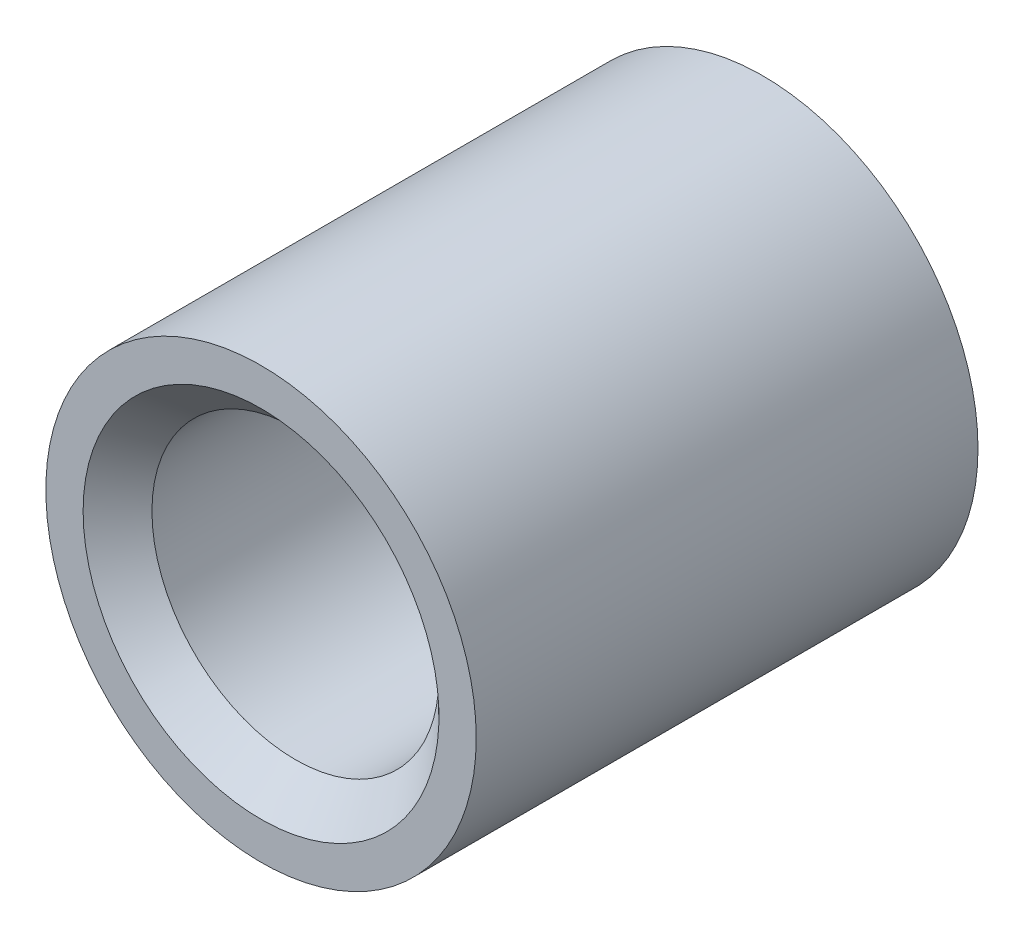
ISO-10303-21;
HEADER;
FILE_DESCRIPTION(('STEP AP214'),'2;1');
FILE_NAME('part.step','',(''),(''),'','','');
FILE_SCHEMA(('AUTOMOTIVE_DESIGN { 1 0 10303 214 1 1 1 1 }'));
ENDSEC;
DATA;
#1=APPLICATION_CONTEXT('core data for automotive mechanical design processes');
#2=APPLICATION_PROTOCOL_DEFINITION('international standard','automotive_design',2000,#1);
#3=PRODUCT_CONTEXT('',#1,'mechanical');
#4=PRODUCT('Part','Part','',(#3));
#5=PRODUCT_RELATED_PRODUCT_CATEGORY('part','',(#4));
#6=PRODUCT_DEFINITION_FORMATION('','',#4);
#7=PRODUCT_DEFINITION_CONTEXT('part definition',#1,'design');
#8=PRODUCT_DEFINITION('design','',#6,#7);
#9=PRODUCT_DEFINITION_SHAPE('','',#8);
#10=(LENGTH_UNIT() NAMED_UNIT(*) SI_UNIT(.MILLI.,.METRE.));
#11=(NAMED_UNIT(*) PLANE_ANGLE_UNIT() SI_UNIT($,.RADIAN.));
#12=(NAMED_UNIT(*) SI_UNIT($,.STERADIAN.) SOLID_ANGLE_UNIT());
#13=UNCERTAINTY_MEASURE_WITH_UNIT(LENGTH_MEASURE(1.E-05),#10,'distance_accuracy_value','');
#14=(GEOMETRIC_REPRESENTATION_CONTEXT(3) GLOBAL_UNCERTAINTY_ASSIGNED_CONTEXT((#13)) GLOBAL_UNIT_ASSIGNED_CONTEXT((#10,
#11,#12)) REPRESENTATION_CONTEXT('',''));
#15=CARTESIAN_POINT('',(0.,0.,0.));
#16=DIRECTION('',(0.,0.,1.));
#17=DIRECTION('',(1.,0.,0.));
#18=AXIS2_PLACEMENT_3D('',#15,#16,#17);
#19=CARTESIAN_POINT('',(0.,0.,31.775));
#20=DIRECTION('',(0.,0.,1.));
#21=DIRECTION('',(1.,0.,0.));
#22=AXIS2_PLACEMENT_3D('',#19,#20,#21);
#23=CYLINDRICAL_SURFACE('',#22,9.53135);
#24=CARTESIAN_POINT('',(0.,0.,0.));
#25=DIRECTION('',(0.,0.,1.));
#26=DIRECTION('',(1.,0.,0.));
#27=AXIS2_PLACEMENT_3D('',#24,#25,#26);
#28=CIRCLE('',#27,9.53135);
#29=CARTESIAN_POINT('',(9.53135,0.,0.));
#30=VERTEX_POINT('',#29);
#31=EDGE_CURVE('E32',#30,#30,#28,.T.);
#32=ORIENTED_EDGE('',*,*,#31,.F.);
#33=EDGE_LOOP('',(#32));
#34=FACE_BOUND('',#33,.T.);
#35=CARTESIAN_POINT('',(0.,0.,-22.225));
#36=DIRECTION('',(0.,0.,1.));
#37=DIRECTION('',(1.,0.,0.));
#38=AXIS2_PLACEMENT_3D('',#35,#36,#37);
#39=CIRCLE('',#38,9.53135);
#40=CARTESIAN_POINT('',(9.53135,0.,-22.225));
#41=VERTEX_POINT('',#40);
#42=EDGE_CURVE('E35',#41,#41,#39,.T.);
#43=ORIENTED_EDGE('',*,*,#42,.T.);
#44=EDGE_LOOP('',(#43));
#45=FACE_BOUND('',#44,.T.);
#46=ADVANCED_FACE('F13',(#34,#45),#23,.T.);
#47=CARTESIAN_POINT('',(9.53135,0.,0.));
#48=DIRECTION('',(0.,0.,-1.));
#49=DIRECTION('',(-1.,0.,0.));
#50=AXIS2_PLACEMENT_3D('',#47,#48,#49);
#51=PLANE('',#50);
#52=CARTESIAN_POINT('',(0.,0.,0.));
#53=DIRECTION('',(0.,0.,-1.));
#54=DIRECTION('',(-1.,0.,0.));
#55=AXIS2_PLACEMENT_3D('',#52,#53,#54);
#56=CIRCLE('',#55,7.88035);
#57=CARTESIAN_POINT('',(-7.88035,0.,0.));
#58=VERTEX_POINT('',#57);
#59=EDGE_CURVE('E9',#58,#58,#56,.T.);
#60=ORIENTED_EDGE('',*,*,#59,.T.);
#61=EDGE_LOOP('',(#60));
#62=FACE_BOUND('',#61,.T.);
#63=ORIENTED_EDGE('',*,*,#31,.T.);
#64=EDGE_LOOP('',(#63));
#65=FACE_BOUND('',#64,.T.);
#66=ADVANCED_FACE('F55',(#62,#65),#51,.F.);
#67=CARTESIAN_POINT('',(0.,0.,31.775));
#68=DIRECTION('',(0.,0.,1.));
#69=DIRECTION('',(1.,0.,0.));
#70=AXIS2_PLACEMENT_3D('',#67,#68,#69);
#71=CYLINDRICAL_SURFACE('',#70,6.35635);
#72=CARTESIAN_POINT('',(0.,0.,-20.701));
#73=DIRECTION('',(0.,0.,1.));
#74=DIRECTION('',(1.,0.,0.));
#75=AXIS2_PLACEMENT_3D('',#72,#73,#74);
#76=CIRCLE('',#75,6.35635);
#77=CARTESIAN_POINT('',(6.35635,0.,-20.701));
#78=VERTEX_POINT('',#77);
#79=EDGE_CURVE('E19',#78,#78,#76,.F.);
#80=ORIENTED_EDGE('',*,*,#79,.T.);
#81=EDGE_LOOP('',(#80));
#82=FACE_BOUND('',#81,.T.);
#83=CARTESIAN_POINT('',(0.,0.,-1.524));
#84=DIRECTION('',(0.,0.,-1.));
#85=DIRECTION('',(-1.,0.,0.));
#86=AXIS2_PLACEMENT_3D('',#83,#84,#85);
#87=CIRCLE('',#86,6.35635);
#88=CARTESIAN_POINT('',(-6.35635,0.,-1.524));
#89=VERTEX_POINT('',#88);
#90=EDGE_CURVE('E23',#89,#89,#87,.F.);
#91=ORIENTED_EDGE('',*,*,#90,.T.);
#92=EDGE_LOOP('',(#91));
#93=FACE_BOUND('',#92,.T.);
#94=ADVANCED_FACE('F43',(#82,#93),#71,.F.);
#95=CARTESIAN_POINT('',(6.35635,0.,-22.225));
#96=DIRECTION('',(0.,0.,1.));
#97=DIRECTION('',(1.,0.,0.));
#98=AXIS2_PLACEMENT_3D('',#95,#96,#97);
#99=PLANE('',#98);
#100=CARTESIAN_POINT('',(0.,0.,-22.225));
#101=DIRECTION('',(0.,0.,1.));
#102=DIRECTION('',(1.,0.,0.));
#103=AXIS2_PLACEMENT_3D('',#100,#101,#102);
#104=CIRCLE('',#103,7.88035);
#105=CARTESIAN_POINT('',(7.88035,0.,-22.225));
#106=VERTEX_POINT('',#105);
#107=EDGE_CURVE('E27',#106,#106,#104,.T.);
#108=ORIENTED_EDGE('',*,*,#107,.T.);
#109=EDGE_LOOP('',(#108));
#110=FACE_BOUND('',#109,.T.);
#111=ORIENTED_EDGE('',*,*,#42,.F.);
#112=EDGE_LOOP('',(#111));
#113=FACE_BOUND('',#112,.T.);
#114=ADVANCED_FACE('F40',(#110,#113),#99,.F.);
#115=CARTESIAN_POINT('',(0.,0.,-22.225));
#116=DIRECTION('',(0.,0.,-1.));
#117=DIRECTION('',(-1.,0.,0.));
#118=AXIS2_PLACEMENT_3D('',#115,#116,#117);
#119=CONICAL_SURFACE('',#118,7.88035,0.785398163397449);
#120=ORIENTED_EDGE('',*,*,#79,.F.);
#121=EDGE_LOOP('',(#120));
#122=FACE_BOUND('',#121,.T.);
#123=ORIENTED_EDGE('',*,*,#107,.F.);
#124=EDGE_LOOP('',(#123));
#125=FACE_BOUND('',#124,.T.);
#126=ADVANCED_FACE('F42',(#122,#125),#119,.F.);
#127=CARTESIAN_POINT('',(0.,0.,-1.524));
#128=DIRECTION('',(0.,0.,1.));
#129=DIRECTION('',(1.,0.,0.));
#130=AXIS2_PLACEMENT_3D('',#127,#128,#129);
#131=CONICAL_SURFACE('',#130,6.35635,0.785398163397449);
#132=ORIENTED_EDGE('',*,*,#59,.F.);
#133=EDGE_LOOP('',(#132));
#134=FACE_BOUND('',#133,.T.);
#135=ORIENTED_EDGE('',*,*,#90,.F.);
#136=EDGE_LOOP('',(#135));
#137=FACE_BOUND('',#136,.T.);
#138=ADVANCED_FACE('F52',(#134,#137),#131,.F.);
#139=CLOSED_SHELL('',(#46,#66,#94,#114,#126,#138));
#140=MANIFOLD_SOLID_BREP('B1',#139);
#141=ADVANCED_BREP_SHAPE_REPRESENTATION('',(#18,#140),#14);
#142=SHAPE_DEFINITION_REPRESENTATION(#9,#141);
ENDSEC;
END-ISO-10303-21;
